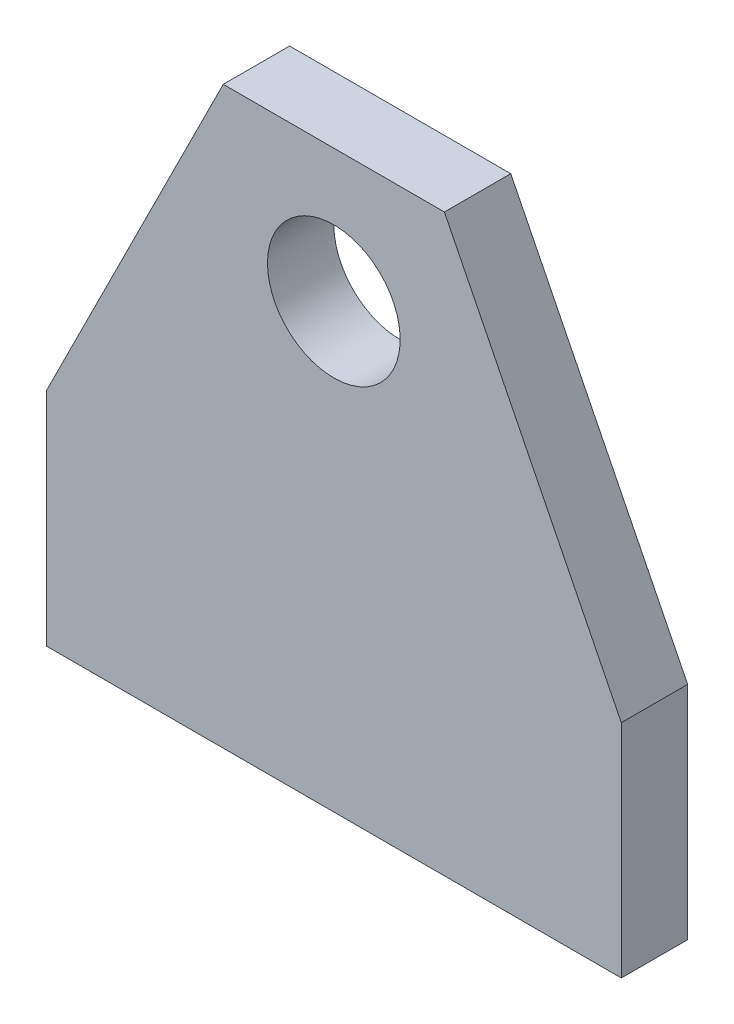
from build123d import *

# Parameters (mm, degrees)
SKETCH1_R          = 9.525
BASE_EXTRUDE_DEPTH = 9.525


with BuildPart() as part:
    # Sketch1 → Base-Extrude (new body)
    with BuildSketch(Plane.XY):
        Polygon((-15.875, 82.55), (15.875, 82.55), (41.275, 31.75), (41.275, 0), (-41.275, 0), (-41.275, 31.75), align=None)
        with Locations(Location((0, 63.5, 0), (0, 0, 180))):
            Circle(SKETCH1_R, mode=Mode.SUBTRACT)
    extrude(amount=BASE_EXTRUDE_DEPTH)


solid = part.part
